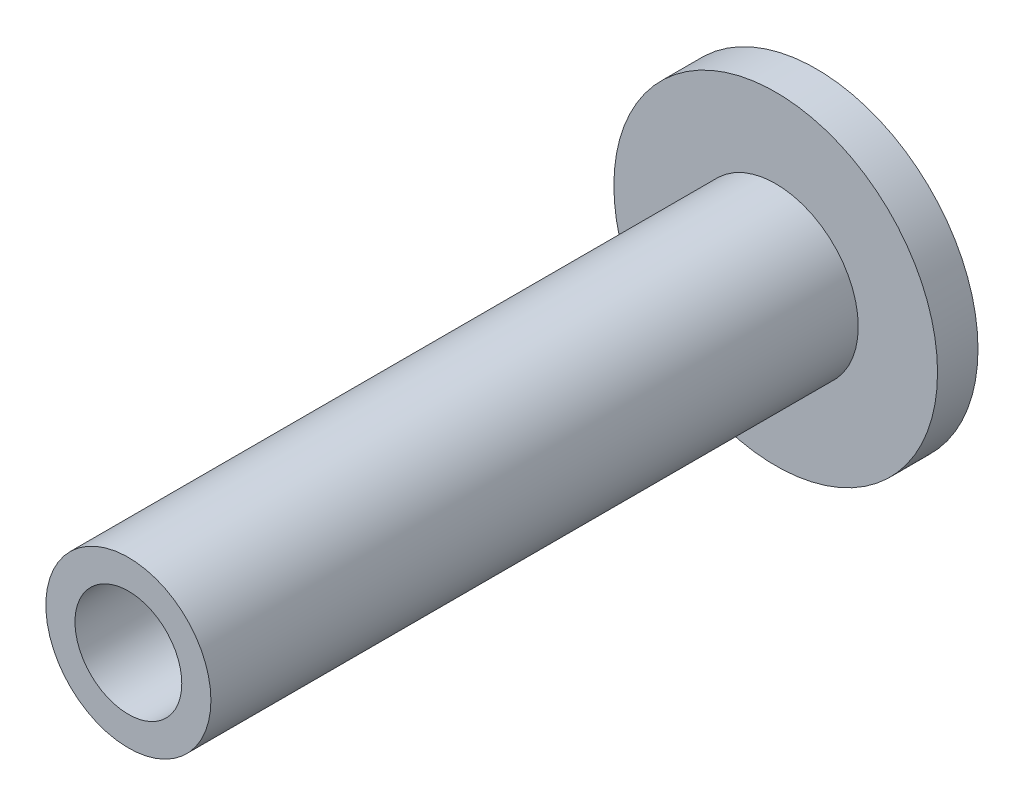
from build123d import *

# Parameters (mm, degrees)
SKETCH1_R          = 6.35
EXTRUDE1_DEPTH     = 1.5875
SKETCH2_R          = 3.2385
EXTRUDE2_DEPTH     = 25.4
SKETCH3_R          = 2.0955
CUT_EXTRUDE1_DEPTH = 120.822077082


with BuildPart() as part:
    # Sketch1 → Extrude1 (new body)
    with BuildSketch(Plane.XY):
        with Locations((-38.1, -101.6)):
            Circle(SKETCH1_R)
    extrude(amount=-EXTRUDE1_DEPTH)

    # Sketch2 → Extrude2 (add)
    with BuildSketch(Plane.XY):
        with Locations((-38.1, -101.6)):
            Circle(SKETCH2_R)
    extrude(amount=EXTRUDE2_DEPTH)

    # Sketch3 → Cut-Extrude1 (cut, through all)
    with BuildSketch(Plane.XY.offset(25.4)):
        with Locations((-38.1, -101.6)):
            Circle(SKETCH3_R)
    extrude(amount=-CUT_EXTRUDE1_DEPTH, mode=Mode.SUBTRACT)


solid = part.part
